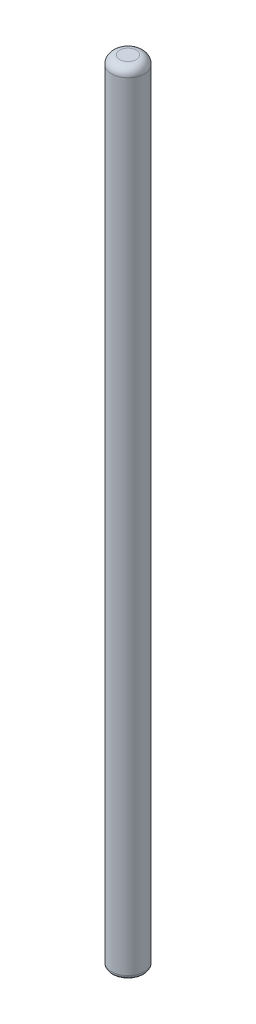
from build123d import *
from OCP.BRepFilletAPI import BRepFilletAPI_MakeFillet

# Parameters (mm, degrees)
SKETCH1_R           = 6.35
BOSS_EXTRUDE1_DEPTH = 304.8
FILLET1_R1          = 1.5875
FILLET1_R2          = 3.175


with BuildPart() as part:
    # Sketch1 → Boss-Extrude1 (new body)
    with BuildSketch(Plane(origin=(0, 0, 0), x_dir=(1, 0, 0), z_dir=(0, 1, 0))):
        with Locations(Location((0, 0, 0), (0, 0, 90))):
            Circle(SKETCH1_R)
    extrude(amount=BOSS_EXTRUDE1_DEPTH)

    # Fillet1: one fillet with a radius per group of edges: ONE call of the kernel's fillet builder (fillet() takes one radius for all edges)
    fillet1_edges_1 = [part.edges().sort_by_distance(p)[0] for p in [
        (0, 0, 6.35),
    ]]
    fillet1_edges_2 = [part.edges().sort_by_distance(p)[0] for p in [
        (0, 304.8, 6.35),
    ]]
    fillet1 = BRepFilletAPI_MakeFillet(part.part.solid().wrapped)
    for e in fillet1_edges_1:
        fillet1.Add(FILLET1_R1, e.wrapped)
    for e in fillet1_edges_2:
        fillet1.Add(FILLET1_R2, e.wrapped)
    add(Compound.cast(fillet1.Shape()), mode=Mode.REPLACE)


solid = part.part
